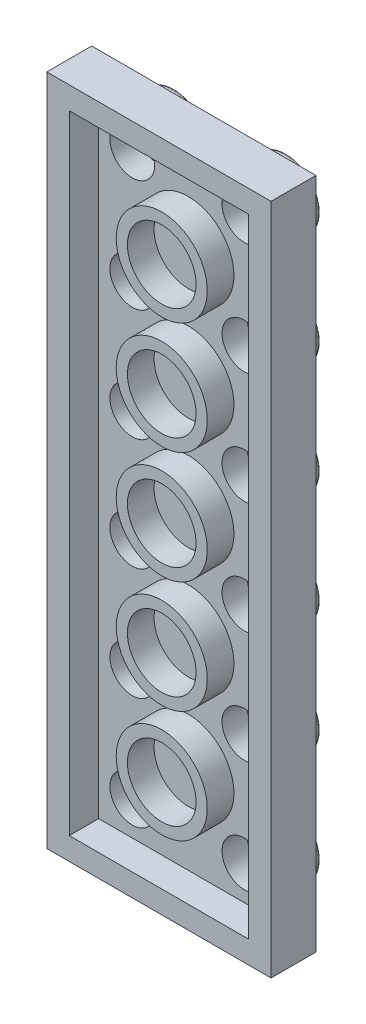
from build123d import *

# Parameters (mm, degrees)
SKIZZE1_W                         = 16
SKIZZE1_H                         = 48
LINEAR_AUSTRAGEN1_DEPTH           = 3.2
SKIZZE2_W                         = 12.8
SKIZZE2_H                         = 44.8
SCHNITT_LINEAR_AUSTRAGEN1_DEPTH   = 2.1
SKIZZE3_R                         = 3.25
SKIZZE3_R_2                       = 2.45
LINEAR_AUSTRAGEN2_DEPTH           = 1.9
SKIZZE4_R                         = 2.45
LINEAR_AUSTRAGEN3_DEPTH           = 1.9
VERRUNDUNG1_R                     = 0.2
LINEARES_MUSTER2_COUNT            = 5
LINEARES_MUSTER2_PITCH            = 8
SKIZZE9_R                         = 1.6
SCHNITT_LINEAR_AUSTRAGEN2_DEPTH   = 1.8
LINEARES_MUSTER1_COUNT            = 2
LINEARES_MUSTER1_PITCH            = 8
LINEARES_MUSTER1_COUNT_DIR2       = 6
LINEARES_MUSTER1_PITCH_DIR2       = 8
VERRUNDUNG1_OF_LINEARES_MUSTER1_R = 0.2


with BuildPart() as part:
    # Skizze1 → Linear austragen1 (new body)
    with BuildSketch(Plane.XY):
        with Locations((-8, -24)):
            Rectangle(SKIZZE1_W, SKIZZE1_H)
    extrude(amount=LINEAR_AUSTRAGEN1_DEPTH)

    # Skizze2 → Schnitt-Linear austragen1 (cut)
    with BuildSketch(Plane.XY.offset(3.2)):
        with Locations((-8, -24)):
            Rectangle(SKIZZE2_W, SKIZZE2_H)
    extrude(amount=-SCHNITT_LINEAR_AUSTRAGEN1_DEPTH, mode=Mode.SUBTRACT)

    # Skizze3 → Linear austragen2 (add)
    with BuildSketch(Plane.XY.offset(1.1)):
        with Locations(Location((-8, -8, 0), (0, 0, 180))):
            Circle(SKIZZE3_R)
        with Locations(Location((-8, -8, 0), (0, 0, 180))):
            Circle(SKIZZE3_R_2, mode=Mode.SUBTRACT)
    linear_austragen2 = extrude(amount=LINEAR_AUSTRAGEN2_DEPTH)

    # Skizze4 → Linear austragen3 (add)
    with BuildSketch(Plane(origin=(0, 0, 0), x_dir=(-1, 0, 0), z_dir=(0, 0, -1))):
        with Locations(Location((4, -4, 0), (0, 0, 180))):
            Circle(SKIZZE4_R)
    linear_austragen3 = extrude(amount=LINEAR_AUSTRAGEN3_DEPTH)

    # Verrundung1
    verrundung1_edges = [part.edges().sort_by_distance(p)[0] for p in [
        (-6.45, -4, -1.9),
    ]]
    fillet(verrundung1_edges, radius=VERRUNDUNG1_R)

    # Lineares Muster2: Linear austragen2 ×5
    with Locations(*[(0, -i * LINEARES_MUSTER2_PITCH, 0) for i in range(1, LINEARES_MUSTER2_COUNT)]):
        add(linear_austragen2)

    # Skizze9 → Schnitt-Linear austragen2 (cut)
    with BuildSketch(Plane.XY.offset(1.1)):
        with Locations((-4, -4)):
            Circle(SKIZZE9_R)
    schnitt_linear_austragen2 = extrude(amount=-SCHNITT_LINEAR_AUSTRAGEN2_DEPTH, mode=Mode.SUBTRACT)

    # Lineares Muster1: Linear austragen3, Schnitt-Linear austragen2 2 × 6
    with Locations(*[(-i * LINEARES_MUSTER1_PITCH, -j * LINEARES_MUSTER1_PITCH_DIR2, 0) for i in range(LINEARES_MUSTER1_COUNT) for j in range(LINEARES_MUSTER1_COUNT_DIR2) if (i, j) != (0, 0)]):
        add(linear_austragen3)
        add(schnitt_linear_austragen2, mode=Mode.SUBTRACT)

    # Verrundung1 of Lineares Muster1
    verrundung1_of_lineares_muster1_edges = [part.edges().sort_by_distance(p)[0] for p in [
        (-6.45, -12, -1.9),
        (-6.45, -20, -1.9),
        (-6.45, -28, -1.9),
        (-6.45, -36, -1.9),
        (-6.45, -44, -1.9),
        (-14.45, -4, -1.9),
        (-14.45, -12, -1.9),
        (-14.45, -20, -1.9),
        (-14.45, -28, -1.9),
        (-14.45, -36, -1.9),
        (-14.45, -44, -1.9),
    ]]
    fillet(verrundung1_of_lineares_muster1_edges, radius=VERRUNDUNG1_OF_LINEARES_MUSTER1_R)


solid = part.part
